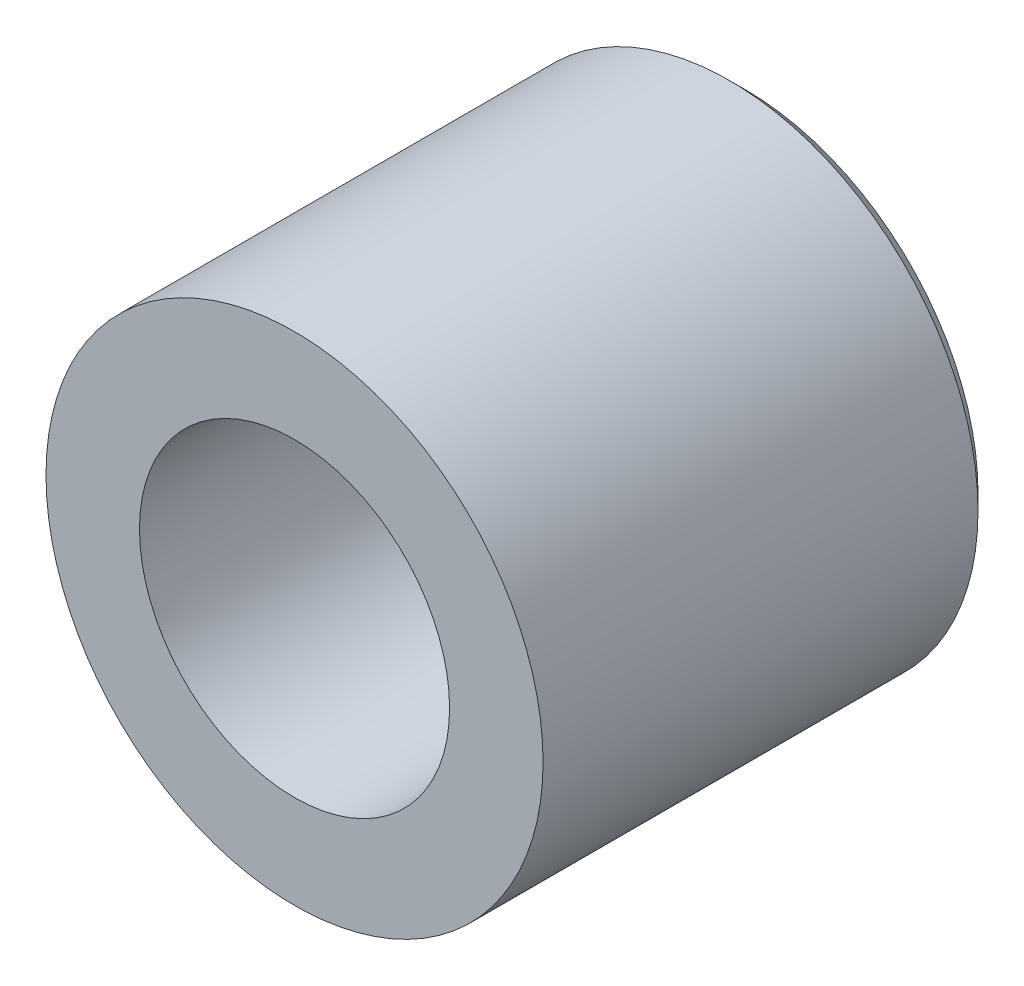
ISO-10303-21;
HEADER;
FILE_DESCRIPTION(('STEP AP214'),'2;1');
FILE_NAME('part.step','',(''),(''),'','','');
FILE_SCHEMA(('AUTOMOTIVE_DESIGN { 1 0 10303 214 1 1 1 1 }'));
ENDSEC;
DATA;
#1=APPLICATION_CONTEXT('core data for automotive mechanical design processes');
#2=APPLICATION_PROTOCOL_DEFINITION('international standard','automotive_design',2000,#1);
#3=PRODUCT_CONTEXT('',#1,'mechanical');
#4=PRODUCT('Part','Part','',(#3));
#5=PRODUCT_RELATED_PRODUCT_CATEGORY('part','',(#4));
#6=PRODUCT_DEFINITION_FORMATION('','',#4);
#7=PRODUCT_DEFINITION_CONTEXT('part definition',#1,'design');
#8=PRODUCT_DEFINITION('design','',#6,#7);
#9=PRODUCT_DEFINITION_SHAPE('','',#8);
#10=(LENGTH_UNIT() NAMED_UNIT(*) SI_UNIT(.MILLI.,.METRE.));
#11=(NAMED_UNIT(*) PLANE_ANGLE_UNIT() SI_UNIT($,.RADIAN.));
#12=(NAMED_UNIT(*) SI_UNIT($,.STERADIAN.) SOLID_ANGLE_UNIT());
#13=UNCERTAINTY_MEASURE_WITH_UNIT(LENGTH_MEASURE(1.E-05),#10,'distance_accuracy_value','');
#14=(GEOMETRIC_REPRESENTATION_CONTEXT(3) GLOBAL_UNCERTAINTY_ASSIGNED_CONTEXT((#13)) GLOBAL_UNIT_ASSIGNED_CONTEXT((#10,
#11,#12)) REPRESENTATION_CONTEXT('',''));
#15=CARTESIAN_POINT('',(0.,0.,0.));
#16=DIRECTION('',(0.,0.,1.));
#17=DIRECTION('',(1.,0.,0.));
#18=AXIS2_PLACEMENT_3D('',#15,#16,#17);
#19=CARTESIAN_POINT('',(0.,0.,-12.9663162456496));
#20=DIRECTION('',(0.,0.,1.));
#21=DIRECTION('',(1.,0.,0.));
#22=AXIS2_PLACEMENT_3D('',#19,#20,#21);
#23=CONICAL_SURFACE('',#22,13.7718577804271,0.785398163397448);
#24=CARTESIAN_POINT('',(-1.25693328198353E-13,0.,-18.));
#25=DIRECTION('',(0.,0.,1.));
#26=DIRECTION('',(-1.,0.,0.));
#27=AXIS2_PLACEMENT_3D('',#24,#25,#26);
#28=CIRCLE('',#27,8.73817402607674);
#29=CARTESIAN_POINT('',(8.73817402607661,0.,-18.));
#30=VERTEX_POINT('',#29);
#31=CARTESIAN_POINT('',(-8.73817402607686,0.,-18.));
#32=VERTEX_POINT('',#31);
#33=EDGE_CURVE('E143',#30,#32,#28,.T.);
#34=ORIENTED_EDGE('',*,*,#33,.F.);
#35=CARTESIAN_POINT('',(8.73817451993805,0.,-17.9999995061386));
#36=CARTESIAN_POINT('',(9.73817237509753,0.,-17.0000016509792));
#37=B_SPLINE_CURVE_WITH_KNOTS('',1,(#35,#36),.UNSPECIFIED.,.F.,.F.,(2,2),(0.634494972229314,
0.70710666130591),.UNSPECIFIED.);
#38=CARTESIAN_POINT('',(9.73817402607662,0.,-17.));
#39=VERTEX_POINT('',#38);
#40=EDGE_CURVE('E44',#30,#39,#37,.T.);
#41=ORIENTED_EDGE('',*,*,#40,.T.);
#42=CARTESIAN_POINT('',(-1.18710365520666E-13,0.,-17.));
#43=DIRECTION('',(0.,0.,-1.));
#44=DIRECTION('',(-1.,0.,0.));
#45=AXIS2_PLACEMENT_3D('',#42,#43,#44);
#46=CIRCLE('',#45,9.73817402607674);
#47=CARTESIAN_POINT('',(-9.73817402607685,0.,-17.));
#48=VERTEX_POINT('',#47);
#49=EDGE_CURVE('E11',#48,#39,#46,.T.);
#50=ORIENTED_EDGE('',*,*,#49,.F.);
#51=CARTESIAN_POINT('',(-1.18710365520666E-13,0.,-17.));
#52=DIRECTION('',(0.,0.,-1.));
#53=DIRECTION('',(-1.,0.,0.));
#54=AXIS2_PLACEMENT_3D('',#51,#52,#53);
#55=CIRCLE('',#54,9.73817402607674);
#56=EDGE_CURVE('E51',#39,#48,#55,.T.);
#57=ORIENTED_EDGE('',*,*,#56,.F.);
#58=ORIENTED_EDGE('',*,*,#40,.F.);
#59=CARTESIAN_POINT('',(-1.25693328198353E-13,0.,-18.));
#60=DIRECTION('',(0.,0.,1.));
#61=DIRECTION('',(-1.,0.,0.));
#62=AXIS2_PLACEMENT_3D('',#59,#60,#61);
#63=CIRCLE('',#62,8.73817402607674);
#64=EDGE_CURVE('E59',#32,#30,#63,.T.);
#65=ORIENTED_EDGE('',*,*,#64,.F.);
#66=EDGE_LOOP('',(#34,#41,#50,#57,#58,#65));
#67=FACE_BOUND('',#66,.T.);
#68=ADVANCED_FACE('F36',(#67),#23,.F.);
#69=CARTESIAN_POINT('',(-1.15218884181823E-13,0.,-16.5));
#70=DIRECTION('',(0.,0.,-1.));
#71=DIRECTION('',(-1.,0.,0.));
#72=AXIS2_PLACEMENT_3D('',#69,#70,#71);
#73=CYLINDRICAL_SURFACE('',#72,9.73817402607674);
#74=CARTESIAN_POINT('',(-1.04744440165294E-13,0.,-15.));
#75=DIRECTION('',(0.,0.,-1.));
#76=DIRECTION('',(-1.,0.,0.));
#77=AXIS2_PLACEMENT_3D('',#74,#75,#76);
#78=CIRCLE('',#77,9.73817402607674);
#79=CARTESIAN_POINT('',(-9.73817402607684,0.,-15.));
#80=VERTEX_POINT('',#79);
#81=EDGE_CURVE('E152',#80,#80,#78,.T.);
#82=ORIENTED_EDGE('',*,*,#81,.F.);
#83=CARTESIAN_POINT('',(-9.73817402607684,0.,-14.9999969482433));
#84=CARTESIAN_POINT('',(-9.73817402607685,0.,-17.0000020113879));
#85=B_SPLINE_CURVE_WITH_KNOTS('',1,(#83,#84),.UNSPECIFIED.,.F.,.F.,(2,2),(0.0833320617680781,
0.91666750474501),.UNSPECIFIED.);
#86=EDGE_CURVE('E147',#80,#48,#85,.T.);
#87=ORIENTED_EDGE('',*,*,#86,.T.);
#88=ORIENTED_EDGE('',*,*,#49,.T.);
#89=ORIENTED_EDGE('',*,*,#56,.T.);
#90=ORIENTED_EDGE('',*,*,#86,.F.);
#91=EDGE_LOOP('',(#82,#87,#88,#89,#90));
#92=FACE_BOUND('',#91,.T.);
#93=ADVANCED_FACE('F191',(#92),#73,.F.);
#94=CARTESIAN_POINT('',(20.0978002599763,-18.1619536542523,-18.));
#95=DIRECTION('',(0.,0.,-1.));
#96=DIRECTION('',(-1.,0.,0.));
#97=AXIS2_PLACEMENT_3D('',#94,#95,#96);
#98=PLANE('',#97);
#99=CARTESIAN_POINT('',(-2.09488880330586E-13,0.,-17.9999999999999));
#100=DIRECTION('',(0.,0.,-1.));
#101=DIRECTION('',(-1.,0.,0.));
#102=AXIS2_PLACEMENT_3D('',#99,#100,#101);
#103=CIRCLE('',#102,4.24999999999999);
#104=CARTESIAN_POINT('',(-4.2500000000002,0.,-17.9999999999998));
#105=VERTEX_POINT('',#104);
#106=EDGE_CURVE('E103',#105,#105,#103,.T.);
#107=ORIENTED_EDGE('',*,*,#106,.T.);
#108=EDGE_LOOP('',(#107));
#109=FACE_BOUND('',#108,.T.);
#110=ORIENTED_EDGE('',*,*,#64,.T.);
#111=ORIENTED_EDGE('',*,*,#33,.T.);
#112=EDGE_LOOP('',(#110,#111));
#113=FACE_BOUND('',#112,.T.);
#114=ADVANCED_FACE('F193',(#109,#113),#98,.F.);
#115=CARTESIAN_POINT('',(0.,0.,-1.));
#116=DIRECTION('',(0.,0.,1.));
#117=DIRECTION('',(-1.,0.,0.));
#118=AXIS2_PLACEMENT_3D('',#115,#116,#117);
#119=CONICAL_SURFACE('',#118,9.98254493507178,0.0174532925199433);
#120=ORIENTED_EDGE('',*,*,#81,.T.);
#121=CARTESIAN_POINT('',(-9.73817402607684,0.,-15.));
#122=CARTESIAN_POINT('',(-9.98254493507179,0.,-0.99999999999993));
#123=B_SPLINE_CURVE_WITH_KNOTS('',1,(#121,#122),.UNSPECIFIED.,.F.,.F.,(2,2),(0.,1.),.UNSPECIFIED.);
#124=CARTESIAN_POINT('',(-9.98254493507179,0.,-0.99999999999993));
#125=VERTEX_POINT('',#124);
#126=EDGE_CURVE('E108',#80,#125,#123,.T.);
#127=ORIENTED_EDGE('',*,*,#126,.T.);
#128=CARTESIAN_POINT('',(0.,0.,-1.));
#129=DIRECTION('',(0.,0.,-1.));
#130=DIRECTION('',(1.,0.,0.));
#131=AXIS2_PLACEMENT_3D('',#128,#129,#130);
#132=CIRCLE('',#131,9.98254493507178);
#133=CARTESIAN_POINT('',(9.98254493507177,0.,-1.00000000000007));
#134=VERTEX_POINT('',#133);
#135=EDGE_CURVE('E133',#134,#125,#132,.T.);
#136=ORIENTED_EDGE('',*,*,#135,.F.);
#137=CARTESIAN_POINT('',(0.,0.,-1.));
#138=DIRECTION('',(0.,0.,-1.));
#139=DIRECTION('',(1.,0.,0.));
#140=AXIS2_PLACEMENT_3D('',#137,#138,#139);
#141=CIRCLE('',#140,9.98254493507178);
#142=EDGE_CURVE('E126',#125,#134,#141,.T.);
#143=ORIENTED_EDGE('',*,*,#142,.F.);
#144=ORIENTED_EDGE('',*,*,#126,.F.);
#145=EDGE_LOOP('',(#120,#127,#136,#143,#144));
#146=FACE_BOUND('',#145,.T.);
#147=ADVANCED_FACE('F189',(#146),#119,.F.);
#148=CARTESIAN_POINT('',(-1.56226912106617E-13,0.,-22.3725830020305));
#149=DIRECTION('',(0.,0.,1.));
#150=DIRECTION('',(1.,0.,0.));
#151=AXIS2_PLACEMENT_3D('',#148,#149,#150);
#152=CONICAL_SURFACE('',#151,22.6274169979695,0.785398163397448);
#153=CARTESIAN_POINT('',(-2.09488880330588E-13,0.,-30.));
#154=DIRECTION('',(0.,0.,1.));
#155=DIRECTION('',(-1.,0.,0.));
#156=AXIS2_PLACEMENT_3D('',#153,#154,#155);
#157=CIRCLE('',#156,15.);
#158=CARTESIAN_POINT('',(-15.,0.,-30.));
#159=VERTEX_POINT('',#158);
#160=CARTESIAN_POINT('',(14.9999999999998,0.,-30.));
#161=VERTEX_POINT('',#160);
#162=EDGE_CURVE('E90',#159,#161,#157,.T.);
#163=ORIENTED_EDGE('',*,*,#162,.T.);
#164=CARTESIAN_POINT('',(15.0000010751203,0.,-29.9999989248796));
#165=CARTESIAN_POINT('',(16.0000024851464,0.,-28.9999975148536));
#166=B_SPLINE_CURVE_WITH_KNOTS('',1,(#164,#165),.UNSPECIFIED.,.F.,.F.,(2,2),(0.662912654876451,
0.707106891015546),.UNSPECIFIED.);
#167=CARTESIAN_POINT('',(16.,0.,-29.));
#168=VERTEX_POINT('',#167);
#169=EDGE_CURVE('E95',#161,#168,#166,.T.);
#170=ORIENTED_EDGE('',*,*,#169,.T.);
#171=CARTESIAN_POINT('',(-2.02505917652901E-13,0.,-29.));
#172=DIRECTION('',(0.,0.,-1.));
#173=DIRECTION('',(-1.,0.,0.));
#174=AXIS2_PLACEMENT_3D('',#171,#172,#173);
#175=CIRCLE('',#174,16.);
#176=CARTESIAN_POINT('',(-16.,0.,-29.));
#177=VERTEX_POINT('',#176);
#178=EDGE_CURVE('E102',#168,#177,#175,.T.);
#179=ORIENTED_EDGE('',*,*,#178,.T.);
#180=CARTESIAN_POINT('',(-2.02505917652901E-13,0.,-29.));
#181=DIRECTION('',(0.,0.,-1.));
#182=DIRECTION('',(-1.,0.,0.));
#183=AXIS2_PLACEMENT_3D('',#180,#181,#182);
#184=CIRCLE('',#183,16.);
#185=EDGE_CURVE('E105',#177,#168,#184,.T.);
#186=ORIENTED_EDGE('',*,*,#185,.T.);
#187=ORIENTED_EDGE('',*,*,#169,.F.);
#188=CARTESIAN_POINT('',(-2.09488880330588E-13,0.,-30.));
#189=DIRECTION('',(0.,0.,1.));
#190=DIRECTION('',(-1.,0.,0.));
#191=AXIS2_PLACEMENT_3D('',#188,#189,#190);
#192=CIRCLE('',#191,15.);
#193=EDGE_CURVE('E97',#161,#159,#192,.T.);
#194=ORIENTED_EDGE('',*,*,#193,.T.);
#195=EDGE_LOOP('',(#163,#170,#179,#186,#187,#194));
#196=FACE_BOUND('',#195,.T.);
#197=ADVANCED_FACE('F92',(#196),#152,.T.);
#198=CARTESIAN_POINT('',(-1.08235921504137E-13,0.,-15.5));
#199=DIRECTION('',(0.,0.,-1.));
#200=DIRECTION('',(-1.,0.,0.));
#201=AXIS2_PLACEMENT_3D('',#198,#199,#200);
#202=CYLINDRICAL_SURFACE('',#201,16.);
#203=CARTESIAN_POINT('',(0.,0.,-1.));
#204=DIRECTION('',(0.,0.,1.));
#205=DIRECTION('',(-1.,0.,0.));
#206=AXIS2_PLACEMENT_3D('',#203,#204,#205);
#207=CIRCLE('',#206,16.);
#208=CARTESIAN_POINT('',(-16.,0.,-0.999999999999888));
#209=VERTEX_POINT('',#208);
#210=EDGE_CURVE('E99',#209,#209,#207,.T.);
#211=ORIENTED_EDGE('',*,*,#210,.F.);
#212=CARTESIAN_POINT('',(-16.,0.,-0.999998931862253));
#213=CARTESIAN_POINT('',(-16.,0.,-28.9999996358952));
#214=B_SPLINE_CURVE_WITH_KNOTS('',1,(#212,#213),.UNSPECIFIED.,.F.,.F.,(2,2),(0.0833333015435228,
0.916666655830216),.UNSPECIFIED.);
#215=EDGE_CURVE('E173',#209,#177,#214,.T.);
#216=ORIENTED_EDGE('',*,*,#215,.T.);
#217=ORIENTED_EDGE('',*,*,#178,.F.);
#218=ORIENTED_EDGE('',*,*,#185,.F.);
#219=ORIENTED_EDGE('',*,*,#215,.F.);
#220=EDGE_LOOP('',(#211,#216,#217,#218,#219));
#221=FACE_BOUND('',#220,.T.);
#222=ADVANCED_FACE('F225',(#221),#202,.T.);
#223=CARTESIAN_POINT('',(34.5,-31.1769145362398,-30.));
#224=DIRECTION('',(0.,0.,-1.));
#225=DIRECTION('',(-1.,0.,0.));
#226=AXIS2_PLACEMENT_3D('',#223,#224,#225);
#227=PLANE('',#226);
#228=CARTESIAN_POINT('',(-2.09488880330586E-13,0.,-29.9999999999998));
#229=DIRECTION('',(0.,0.,-1.));
#230=DIRECTION('',(-1.,0.,0.));
#231=AXIS2_PLACEMENT_3D('',#228,#229,#230);
#232=CIRCLE('',#231,4.24999999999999);
#233=CARTESIAN_POINT('',(-4.2500000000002,0.,-29.9999999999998));
#234=VERTEX_POINT('',#233);
#235=EDGE_CURVE('E275',#234,#234,#232,.T.);
#236=ORIENTED_EDGE('',*,*,#235,.F.);
#237=EDGE_LOOP('',(#236));
#238=FACE_BOUND('',#237,.T.);
#239=ORIENTED_EDGE('',*,*,#193,.F.);
#240=ORIENTED_EDGE('',*,*,#162,.F.);
#241=EDGE_LOOP('',(#239,#240));
#242=FACE_BOUND('',#241,.T.);
#243=ADVANCED_FACE('F101',(#238,#242),#227,.T.);
#244=CARTESIAN_POINT('',(-20.8,-33.2553755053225,-0.999999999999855));
#245=DIRECTION('',(0.,0.,1.));
#246=DIRECTION('',(1.,0.,0.));
#247=AXIS2_PLACEMENT_3D('',#244,#245,#246);
#248=PLANE('',#247);
#249=ORIENTED_EDGE('',*,*,#210,.T.);
#250=EDGE_LOOP('',(#249));
#251=FACE_BOUND('',#250,.T.);
#252=ORIENTED_EDGE('',*,*,#135,.T.);
#253=ORIENTED_EDGE('',*,*,#142,.T.);
#254=EDGE_LOOP('',(#252,#253));
#255=FACE_BOUND('',#254,.T.);
#256=ADVANCED_FACE('F240',(#251,#255),#248,.T.);
#257=CARTESIAN_POINT('',(-2.09488880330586E-13,0.,-29.9999999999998));
#258=DIRECTION('',(0.,0.,-1.));
#259=DIRECTION('',(-1.,0.,0.));
#260=AXIS2_PLACEMENT_3D('',#257,#258,#259);
#261=CYLINDRICAL_SURFACE('',#260,4.24999999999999);
#262=ORIENTED_EDGE('',*,*,#235,.T.);
#263=EDGE_LOOP('',(#262));
#264=FACE_BOUND('',#263,.T.);
#265=ORIENTED_EDGE('',*,*,#106,.F.);
#266=EDGE_LOOP('',(#265));
#267=FACE_BOUND('',#266,.T.);
#268=ADVANCED_FACE('F248',(#264,#267),#261,.F.);
#269=CLOSED_SHELL('',(#68,#93,#114,#147,#197,#222,#243,#256,#268));
#270=MANIFOLD_SOLID_BREP('B2',#269);
#271=ADVANCED_BREP_SHAPE_REPRESENTATION('',(#18,#270),#14);
#272=SHAPE_DEFINITION_REPRESENTATION(#9,#271);
ENDSEC;
END-ISO-10303-21;
